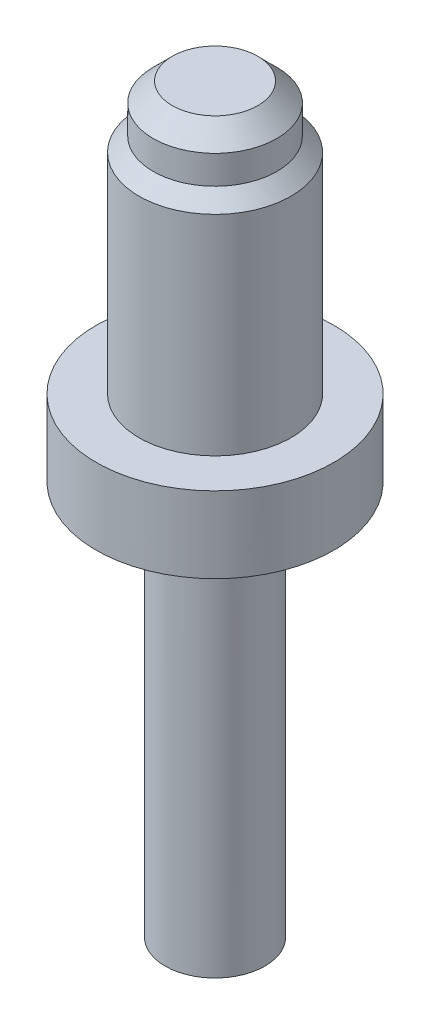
ISO-10303-21;
HEADER;
FILE_DESCRIPTION(('STEP AP214'),'2;1');
FILE_NAME('part.step','',(''),(''),'','','');
FILE_SCHEMA(('AUTOMOTIVE_DESIGN { 1 0 10303 214 1 1 1 1 }'));
ENDSEC;
DATA;
#1=APPLICATION_CONTEXT('core data for automotive mechanical design processes');
#2=APPLICATION_PROTOCOL_DEFINITION('international standard','automotive_design',2000,#1);
#3=PRODUCT_CONTEXT('',#1,'mechanical');
#4=PRODUCT('Part','Part','',(#3));
#5=PRODUCT_RELATED_PRODUCT_CATEGORY('part','',(#4));
#6=PRODUCT_DEFINITION_FORMATION('','',#4);
#7=PRODUCT_DEFINITION_CONTEXT('part definition',#1,'design');
#8=PRODUCT_DEFINITION('design','',#6,#7);
#9=PRODUCT_DEFINITION_SHAPE('','',#8);
#10=(LENGTH_UNIT() NAMED_UNIT(*) SI_UNIT(.MILLI.,.METRE.));
#11=(NAMED_UNIT(*) PLANE_ANGLE_UNIT() SI_UNIT($,.RADIAN.));
#12=(NAMED_UNIT(*) SI_UNIT($,.STERADIAN.) SOLID_ANGLE_UNIT());
#13=UNCERTAINTY_MEASURE_WITH_UNIT(LENGTH_MEASURE(1.E-05),#10,'distance_accuracy_value','');
#14=(GEOMETRIC_REPRESENTATION_CONTEXT(3) GLOBAL_UNCERTAINTY_ASSIGNED_CONTEXT((#13)) GLOBAL_UNIT_ASSIGNED_CONTEXT((#10,
#11,#12)) REPRESENTATION_CONTEXT('',''));
#15=CARTESIAN_POINT('',(0.,0.,0.));
#16=DIRECTION('',(0.,0.,1.));
#17=DIRECTION('',(1.,0.,0.));
#18=AXIS2_PLACEMENT_3D('',#15,#16,#17);
#19=CARTESIAN_POINT('',(0.,0.,0.));
#20=DIRECTION('',(0.,-1.,0.));
#21=DIRECTION('',(0.,0.,-1.));
#22=AXIS2_PLACEMENT_3D('',#19,#20,#21);
#23=CYLINDRICAL_SURFACE('',#22,8.);
#24=CARTESIAN_POINT('',(0.,22.,0.));
#25=DIRECTION('',(0.,-1.,0.));
#26=DIRECTION('',(0.,0.,-1.));
#27=AXIS2_PLACEMENT_3D('',#24,#25,#26);
#28=CIRCLE('',#27,8.);
#29=CARTESIAN_POINT('',(0.,22.,-8.));
#30=VERTEX_POINT('',#29);
#31=EDGE_CURVE('E35',#30,#30,#28,.T.);
#32=ORIENTED_EDGE('',*,*,#31,.T.);
#33=EDGE_LOOP('',(#32));
#34=FACE_BOUND('',#33,.T.);
#35=CARTESIAN_POINT('',(0.,0.,0.));
#36=DIRECTION('',(0.,-1.,0.));
#37=DIRECTION('',(0.,0.,-1.));
#38=AXIS2_PLACEMENT_3D('',#35,#36,#37);
#39=CIRCLE('',#38,8.);
#40=CARTESIAN_POINT('',(0.,0.,-8.));
#41=VERTEX_POINT('',#40);
#42=EDGE_CURVE('E27',#41,#41,#39,.T.);
#43=ORIENTED_EDGE('',*,*,#42,.F.);
#44=EDGE_LOOP('',(#43));
#45=FACE_BOUND('',#44,.T.);
#46=ADVANCED_FACE('F12',(#34,#45),#23,.T.);
#47=CARTESIAN_POINT('',(8.,0.,0.));
#48=DIRECTION('',(0.,1.,0.));
#49=DIRECTION('',(0.,0.,1.));
#50=AXIS2_PLACEMENT_3D('',#47,#48,#49);
#51=PLANE('',#50);
#52=ORIENTED_EDGE('',*,*,#42,.T.);
#53=EDGE_LOOP('',(#52));
#54=FACE_BOUND('',#53,.T.);
#55=CARTESIAN_POINT('',(0.,0.,0.));
#56=DIRECTION('',(0.,-1.,0.));
#57=DIRECTION('',(0.,0.,-1.));
#58=AXIS2_PLACEMENT_3D('',#55,#56,#57);
#59=CIRCLE('',#58,12.5);
#60=CARTESIAN_POINT('',(0.,0.,-12.5));
#61=VERTEX_POINT('',#60);
#62=EDGE_CURVE('E32',#61,#61,#59,.T.);
#63=ORIENTED_EDGE('',*,*,#62,.F.);
#64=EDGE_LOOP('',(#63));
#65=FACE_BOUND('',#64,.T.);
#66=ADVANCED_FACE('F64',(#54,#65),#51,.T.);
#67=CARTESIAN_POINT('',(0.,0.,0.));
#68=DIRECTION('',(0.,-1.,0.));
#69=DIRECTION('',(0.,0.,-1.));
#70=AXIS2_PLACEMENT_3D('',#67,#68,#69);
#71=CYLINDRICAL_SURFACE('',#70,12.5);
#72=ORIENTED_EDGE('',*,*,#62,.T.);
#73=EDGE_LOOP('',(#72));
#74=FACE_BOUND('',#73,.T.);
#75=CARTESIAN_POINT('',(0.,-8.,0.));
#76=DIRECTION('',(0.,1.,0.));
#77=DIRECTION('',(-1.,0.,0.));
#78=AXIS2_PLACEMENT_3D('',#75,#76,#77);
#79=CIRCLE('',#78,12.5);
#80=CARTESIAN_POINT('',(-12.5,-8.,0.));
#81=VERTEX_POINT('',#80);
#82=EDGE_CURVE('E41',#81,#81,#79,.T.);
#83=ORIENTED_EDGE('',*,*,#82,.T.);
#84=EDGE_LOOP('',(#83));
#85=FACE_BOUND('',#84,.T.);
#86=ADVANCED_FACE('F70',(#74,#85),#71,.T.);
#87=CARTESIAN_POINT('',(0.,23.5,0.));
#88=DIRECTION('',(0.,-1.,0.));
#89=DIRECTION('',(0.,0.,-1.));
#90=AXIS2_PLACEMENT_3D('',#87,#88,#89);
#91=CONICAL_SURFACE('',#90,6.5,0.785398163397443);
#92=ORIENTED_EDGE('',*,*,#31,.F.);
#93=EDGE_LOOP('',(#92));
#94=FACE_BOUND('',#93,.T.);
#95=CARTESIAN_POINT('',(0.,23.5,0.));
#96=DIRECTION('',(0.,-1.,0.));
#97=DIRECTION('',(0.,0.,-1.));
#98=AXIS2_PLACEMENT_3D('',#95,#96,#97);
#99=CIRCLE('',#98,6.5);
#100=CARTESIAN_POINT('',(0.,23.5,-6.5));
#101=VERTEX_POINT('',#100);
#102=EDGE_CURVE('E38',#101,#101,#99,.T.);
#103=ORIENTED_EDGE('',*,*,#102,.T.);
#104=EDGE_LOOP('',(#103));
#105=FACE_BOUND('',#104,.T.);
#106=ADVANCED_FACE('F77',(#94,#105),#91,.T.);
#107=CARTESIAN_POINT('',(0.,0.,0.));
#108=DIRECTION('',(0.,-1.,0.));
#109=DIRECTION('',(0.,0.,-1.));
#110=AXIS2_PLACEMENT_3D('',#107,#108,#109);
#111=CYLINDRICAL_SURFACE('',#110,6.5);
#112=CARTESIAN_POINT('',(0.,26.5,0.));
#113=DIRECTION('',(0.,1.,0.));
#114=DIRECTION('',(0.,0.,1.));
#115=AXIS2_PLACEMENT_3D('',#112,#113,#114);
#116=CIRCLE('',#115,6.5);
#117=CARTESIAN_POINT('',(0.,26.5,6.5));
#118=VERTEX_POINT('',#117);
#119=EDGE_CURVE('E23',#118,#118,#116,.F.);
#120=ORIENTED_EDGE('',*,*,#119,.T.);
#121=EDGE_LOOP('',(#120));
#122=FACE_BOUND('',#121,.T.);
#123=ORIENTED_EDGE('',*,*,#102,.F.);
#124=EDGE_LOOP('',(#123));
#125=FACE_BOUND('',#124,.T.);
#126=ADVANCED_FACE('F82',(#122,#125),#111,.T.);
#127=CARTESIAN_POINT('',(0.,28.5,0.));
#128=DIRECTION('',(0.,1.,0.));
#129=DIRECTION('',(0.,0.,1.));
#130=AXIS2_PLACEMENT_3D('',#127,#128,#129);
#131=PLANE('',#130);
#132=CARTESIAN_POINT('',(0.,28.5,0.));
#133=DIRECTION('',(0.,1.,0.));
#134=DIRECTION('',(0.,0.,1.));
#135=AXIS2_PLACEMENT_3D('',#132,#133,#134);
#136=CIRCLE('',#135,4.5);
#137=CARTESIAN_POINT('',(0.,28.5,4.5));
#138=VERTEX_POINT('',#137);
#139=EDGE_CURVE('E19',#138,#138,#136,.T.);
#140=ORIENTED_EDGE('',*,*,#139,.T.);
#141=EDGE_LOOP('',(#140));
#142=FACE_BOUND('',#141,.T.);
#143=ADVANCED_FACE('F79',(#142),#131,.T.);
#144=CARTESIAN_POINT('',(0.,26.5,0.));
#145=DIRECTION('',(0.,-1.,0.));
#146=DIRECTION('',(0.,0.,-1.));
#147=AXIS2_PLACEMENT_3D('',#144,#145,#146);
#148=CONICAL_SURFACE('',#147,6.5,0.78539816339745);
#149=ORIENTED_EDGE('',*,*,#139,.F.);
#150=EDGE_LOOP('',(#149));
#151=FACE_BOUND('',#150,.T.);
#152=ORIENTED_EDGE('',*,*,#119,.F.);
#153=EDGE_LOOP('',(#152));
#154=FACE_BOUND('',#153,.T.);
#155=ADVANCED_FACE('F14',(#151,#154),#148,.T.);
#156=CARTESIAN_POINT('',(0.,-49.5,0.));
#157=DIRECTION('',(0.,-1.,0.));
#158=DIRECTION('',(1.,0.,0.));
#159=AXIS2_PLACEMENT_3D('',#156,#157,#158);
#160=PLANE('',#159);
#161=CARTESIAN_POINT('',(0.,-49.5,0.));
#162=DIRECTION('',(0.,-1.,0.));
#163=DIRECTION('',(1.,0.,0.));
#164=AXIS2_PLACEMENT_3D('',#161,#162,#163);
#165=CIRCLE('',#164,5.25);
#166=CARTESIAN_POINT('',(5.25000000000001,-49.5,0.));
#167=VERTEX_POINT('',#166);
#168=EDGE_CURVE('E44',#167,#167,#165,.T.);
#169=ORIENTED_EDGE('',*,*,#168,.T.);
#170=EDGE_LOOP('',(#169));
#171=FACE_BOUND('',#170,.T.);
#172=ADVANCED_FACE('F48',(#171),#160,.T.);
#173=CARTESIAN_POINT('',(0.,-49.5,0.));
#174=DIRECTION('',(0.,1.,0.));
#175=DIRECTION('',(-1.,0.,0.));
#176=AXIS2_PLACEMENT_3D('',#173,#174,#175);
#177=CYLINDRICAL_SURFACE('',#176,5.25);
#178=ORIENTED_EDGE('',*,*,#168,.F.);
#179=EDGE_LOOP('',(#178));
#180=FACE_BOUND('',#179,.T.);
#181=CARTESIAN_POINT('',(0.,-8.,0.));
#182=DIRECTION('',(0.,1.,0.));
#183=DIRECTION('',(-1.,0.,0.));
#184=AXIS2_PLACEMENT_3D('',#181,#182,#183);
#185=CIRCLE('',#184,5.25);
#186=CARTESIAN_POINT('',(-5.25,-8.,0.));
#187=VERTEX_POINT('',#186);
#188=EDGE_CURVE('E8',#187,#187,#185,.F.);
#189=ORIENTED_EDGE('',*,*,#188,.T.);
#190=EDGE_LOOP('',(#189));
#191=FACE_BOUND('',#190,.T.);
#192=ADVANCED_FACE('F50',(#180,#191),#177,.T.);
#193=CARTESIAN_POINT('',(0.,-8.,0.));
#194=DIRECTION('',(0.,1.,0.));
#195=DIRECTION('',(-1.,0.,0.));
#196=AXIS2_PLACEMENT_3D('',#193,#194,#195);
#197=PLANE('',#196);
#198=ORIENTED_EDGE('',*,*,#188,.F.);
#199=EDGE_LOOP('',(#198));
#200=FACE_BOUND('',#199,.T.);
#201=ORIENTED_EDGE('',*,*,#82,.F.);
#202=EDGE_LOOP('',(#201));
#203=FACE_BOUND('',#202,.T.);
#204=ADVANCED_FACE('F52',(#200,#203),#197,.F.);
#205=CLOSED_SHELL('',(#46,#66,#86,#106,#126,#143,#155,#172,#192,#204));
#206=MANIFOLD_SOLID_BREP('B1',#205);
#207=ADVANCED_BREP_SHAPE_REPRESENTATION('',(#18,#206),#14);
#208=SHAPE_DEFINITION_REPRESENTATION(#9,#207);
ENDSEC;
END-ISO-10303-21;
